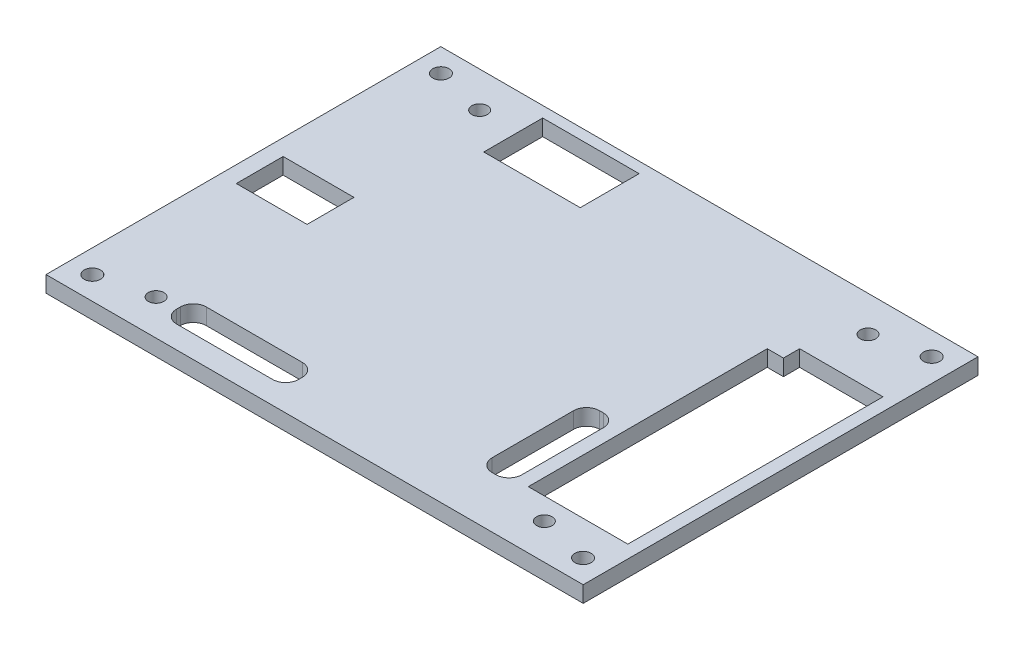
ISO-10303-21;
HEADER;
FILE_DESCRIPTION(('STEP AP214'),'2;1');
FILE_NAME('part.step','',(''),(''),'','','');
FILE_SCHEMA(('AUTOMOTIVE_DESIGN { 1 0 10303 214 1 1 1 1 }'));
ENDSEC;
DATA;
#1=APPLICATION_CONTEXT('core data for automotive mechanical design processes');
#2=APPLICATION_PROTOCOL_DEFINITION('international standard','automotive_design',2000,#1);
#3=PRODUCT_CONTEXT('',#1,'mechanical');
#4=PRODUCT('Part','Part','',(#3));
#5=PRODUCT_RELATED_PRODUCT_CATEGORY('part','',(#4));
#6=PRODUCT_DEFINITION_FORMATION('','',#4);
#7=PRODUCT_DEFINITION_CONTEXT('part definition',#1,'design');
#8=PRODUCT_DEFINITION('design','',#6,#7);
#9=PRODUCT_DEFINITION_SHAPE('','',#8);
#10=(LENGTH_UNIT() NAMED_UNIT(*) SI_UNIT(.MILLI.,.METRE.));
#11=(NAMED_UNIT(*) PLANE_ANGLE_UNIT() SI_UNIT($,.RADIAN.));
#12=(NAMED_UNIT(*) SI_UNIT($,.STERADIAN.) SOLID_ANGLE_UNIT());
#13=UNCERTAINTY_MEASURE_WITH_UNIT(LENGTH_MEASURE(1.E-05),#10,'distance_accuracy_value','');
#14=(GEOMETRIC_REPRESENTATION_CONTEXT(3) GLOBAL_UNCERTAINTY_ASSIGNED_CONTEXT((#13)) GLOBAL_UNIT_ASSIGNED_CONTEXT((#10,
#11,#12)) REPRESENTATION_CONTEXT('',''));
#15=CARTESIAN_POINT('',(0.,0.,0.));
#16=DIRECTION('',(0.,0.,1.));
#17=DIRECTION('',(1.,0.,0.));
#18=AXIS2_PLACEMENT_3D('',#15,#16,#17);
#19=CARTESIAN_POINT('',(0.,3.175,0.));
#20=DIRECTION('',(1.,0.,0.));
#21=DIRECTION('',(0.,0.,-1.));
#22=AXIS2_PLACEMENT_3D('',#19,#20,#21);
#23=PLANE('',#22);
#24=DIRECTION('',(0.,0.,1.));
#25=VECTOR('',#24,1.);
#26=CARTESIAN_POINT('',(0.,0.,0.));
#27=LINE('',#26,#25);
#28=CARTESIAN_POINT('',(0.,0.,-77.47));
#29=VERTEX_POINT('',#28);
#30=CARTESIAN_POINT('',(0.,0.,0.));
#31=VERTEX_POINT('',#30);
#32=EDGE_CURVE('E392',#29,#31,#27,.T.);
#33=ORIENTED_EDGE('',*,*,#32,.T.);
#34=DIRECTION('',(0.,-1.,0.));
#35=VECTOR('',#34,1.);
#36=CARTESIAN_POINT('',(0.,3.175,0.));
#37=LINE('',#36,#35);
#38=CARTESIAN_POINT('',(0.,3.175,0.));
#39=VERTEX_POINT('',#38);
#40=EDGE_CURVE('E421',#39,#31,#37,.T.);
#41=ORIENTED_EDGE('',*,*,#40,.F.);
#42=DIRECTION('',(0.,0.,1.));
#43=VECTOR('',#42,1.);
#44=CARTESIAN_POINT('',(0.,3.175,0.));
#45=LINE('',#44,#43);
#46=CARTESIAN_POINT('',(0.,3.175,-77.47));
#47=VERTEX_POINT('',#46);
#48=EDGE_CURVE('E395',#47,#39,#45,.T.);
#49=ORIENTED_EDGE('',*,*,#48,.F.);
#50=DIRECTION('',(0.,-1.,0.));
#51=VECTOR('',#50,1.);
#52=CARTESIAN_POINT('',(0.,3.175,-77.47));
#53=LINE('',#52,#51);
#54=EDGE_CURVE('E405',#47,#29,#53,.T.);
#55=ORIENTED_EDGE('',*,*,#54,.T.);
#56=EDGE_LOOP('',(#33,#41,#49,#55));
#57=FACE_BOUND('',#56,.T.);
#58=ADVANCED_FACE('F31',(#57),#23,.F.);
#59=CARTESIAN_POINT('',(0.,3.175,0.));
#60=DIRECTION('',(0.,0.,-1.));
#61=DIRECTION('',(-1.,0.,0.));
#62=AXIS2_PLACEMENT_3D('',#59,#60,#61);
#63=PLANE('',#62);
#64=DIRECTION('',(1.,0.,0.));
#65=VECTOR('',#64,1.);
#66=CARTESIAN_POINT('',(0.,0.,0.));
#67=LINE('',#66,#65);
#68=CARTESIAN_POINT('',(105.41,0.,0.));
#69=VERTEX_POINT('',#68);
#70=EDGE_CURVE('E408',#31,#69,#67,.T.);
#71=ORIENTED_EDGE('',*,*,#70,.T.);
#72=DIRECTION('',(0.,-1.,0.));
#73=VECTOR('',#72,1.);
#74=CARTESIAN_POINT('',(105.41,3.175,0.));
#75=LINE('',#74,#73);
#76=CARTESIAN_POINT('',(105.41,3.175,0.));
#77=VERTEX_POINT('',#76);
#78=EDGE_CURVE('E418',#77,#69,#75,.T.);
#79=ORIENTED_EDGE('',*,*,#78,.F.);
#80=DIRECTION('',(1.,0.,0.));
#81=VECTOR('',#80,1.);
#82=CARTESIAN_POINT('',(0.,3.175,0.));
#83=LINE('',#82,#81);
#84=EDGE_CURVE('E398',#39,#77,#83,.T.);
#85=ORIENTED_EDGE('',*,*,#84,.F.);
#86=ORIENTED_EDGE('',*,*,#40,.T.);
#87=EDGE_LOOP('',(#71,#79,#85,#86));
#88=FACE_BOUND('',#87,.T.);
#89=ADVANCED_FACE('F582',(#88),#63,.F.);
#90=CARTESIAN_POINT('',(105.41,3.175,0.));
#91=DIRECTION('',(-1.,0.,0.));
#92=DIRECTION('',(0.,0.,1.));
#93=AXIS2_PLACEMENT_3D('',#90,#91,#92);
#94=PLANE('',#93);
#95=DIRECTION('',(0.,0.,-1.));
#96=VECTOR('',#95,1.);
#97=CARTESIAN_POINT('',(105.41,0.,0.));
#98=LINE('',#97,#96);
#99=CARTESIAN_POINT('',(105.41,0.,-77.47));
#100=VERTEX_POINT('',#99);
#101=EDGE_CURVE('E410',#69,#100,#98,.T.);
#102=ORIENTED_EDGE('',*,*,#101,.T.);
#103=DIRECTION('',(0.,-1.,0.));
#104=VECTOR('',#103,1.);
#105=CARTESIAN_POINT('',(105.41,3.175,-77.47));
#106=LINE('',#105,#104);
#107=CARTESIAN_POINT('',(105.41,3.175,-77.47));
#108=VERTEX_POINT('',#107);
#109=EDGE_CURVE('E415',#108,#100,#106,.T.);
#110=ORIENTED_EDGE('',*,*,#109,.F.);
#111=DIRECTION('',(0.,0.,-1.));
#112=VECTOR('',#111,1.);
#113=CARTESIAN_POINT('',(105.41,3.175,0.));
#114=LINE('',#113,#112);
#115=EDGE_CURVE('E401',#77,#108,#114,.T.);
#116=ORIENTED_EDGE('',*,*,#115,.F.);
#117=ORIENTED_EDGE('',*,*,#78,.T.);
#118=EDGE_LOOP('',(#102,#110,#116,#117));
#119=FACE_BOUND('',#118,.T.);
#120=ADVANCED_FACE('F588',(#119),#94,.F.);
#121=CARTESIAN_POINT('',(0.,3.175,-77.47));
#122=DIRECTION('',(0.,0.,1.));
#123=DIRECTION('',(1.,0.,0.));
#124=AXIS2_PLACEMENT_3D('',#121,#122,#123);
#125=PLANE('',#124);
#126=DIRECTION('',(-1.,0.,0.));
#127=VECTOR('',#126,1.);
#128=CARTESIAN_POINT('',(0.,0.,-77.47));
#129=LINE('',#128,#127);
#130=EDGE_CURVE('E399',#100,#29,#129,.T.);
#131=ORIENTED_EDGE('',*,*,#130,.T.);
#132=ORIENTED_EDGE('',*,*,#54,.F.);
#133=DIRECTION('',(-1.,0.,0.));
#134=VECTOR('',#133,1.);
#135=CARTESIAN_POINT('',(0.,3.175,-77.47));
#136=LINE('',#135,#134);
#137=EDGE_CURVE('E403',#108,#47,#136,.T.);
#138=ORIENTED_EDGE('',*,*,#137,.F.);
#139=ORIENTED_EDGE('',*,*,#109,.T.);
#140=EDGE_LOOP('',(#131,#132,#138,#139));
#141=FACE_BOUND('',#140,.T.);
#142=ADVANCED_FACE('F664',(#141),#125,.F.);
#143=CARTESIAN_POINT('',(0.,3.175,-77.47));
#144=DIRECTION('',(0.,-1.,0.));
#145=DIRECTION('',(0.,0.,-1.));
#146=AXIS2_PLACEMENT_3D('',#143,#144,#145);
#147=PLANE('',#146);
#148=CARTESIAN_POINT('',(4.55930000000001,3.175,-4.53389999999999));
#149=DIRECTION('',(0.,1.,0.));
#150=DIRECTION('',(0.,0.,-1.));
#151=AXIS2_PLACEMENT_3D('',#148,#149,#150);
#152=CIRCLE('',#151,1.6);
#153=CARTESIAN_POINT('',(4.55930000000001,3.175,-6.13389999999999));
#154=VERTEX_POINT('',#153);
#155=EDGE_CURVE('E652',#154,#154,#152,.T.);
#156=ORIENTED_EDGE('',*,*,#155,.F.);
#157=EDGE_LOOP('',(#156));
#158=FACE_BOUND('',#157,.T.);
#159=CARTESIAN_POINT('',(100.8507,3.175,-4.53389999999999));
#160=DIRECTION('',(0.,1.,0.));
#161=DIRECTION('',(0.,0.,1.));
#162=AXIS2_PLACEMENT_3D('',#159,#160,#161);
#163=CIRCLE('',#162,1.60000000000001);
#164=CARTESIAN_POINT('',(100.8507,3.175,-2.93389999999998));
#165=VERTEX_POINT('',#164);
#166=EDGE_CURVE('E646',#165,#165,#163,.T.);
#167=ORIENTED_EDGE('',*,*,#166,.F.);
#168=EDGE_LOOP('',(#167));
#169=FACE_BOUND('',#168,.T.);
#170=CARTESIAN_POINT('',(100.8507,3.175,-72.9361));
#171=DIRECTION('',(0.,1.,0.));
#172=DIRECTION('',(0.,0.,-1.));
#173=AXIS2_PLACEMENT_3D('',#170,#171,#172);
#174=CIRCLE('',#173,1.60000000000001);
#175=CARTESIAN_POINT('',(100.8507,3.175,-74.5361));
#176=VERTEX_POINT('',#175);
#177=EDGE_CURVE('E641',#176,#176,#174,.T.);
#178=ORIENTED_EDGE('',*,*,#177,.F.);
#179=EDGE_LOOP('',(#178));
#180=FACE_BOUND('',#179,.T.);
#181=CARTESIAN_POINT('',(4.55930000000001,3.175,-72.9361));
#182=DIRECTION('',(0.,1.,0.));
#183=DIRECTION('',(0.,0.,1.));
#184=AXIS2_PLACEMENT_3D('',#181,#182,#183);
#185=CIRCLE('',#184,1.6);
#186=CARTESIAN_POINT('',(4.55930000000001,3.175,-71.3361));
#187=VERTEX_POINT('',#186);
#188=EDGE_CURVE('E635',#187,#187,#185,.T.);
#189=ORIENTED_EDGE('',*,*,#188,.F.);
#190=EDGE_LOOP('',(#189));
#191=FACE_BOUND('',#190,.T.);
#192=DIRECTION('',(1.,0.,0.));
#193=VECTOR('',#192,1.);
#194=CARTESIAN_POINT('',(74.8919,3.175,-10.1219));
#195=LINE('',#194,#193);
#196=CARTESIAN_POINT('',(77.4319,3.175,-10.1219));
#197=VERTEX_POINT('',#196);
#198=CARTESIAN_POINT('',(78.1685,3.175,-10.1219));
#199=VERTEX_POINT('',#198);
#200=EDGE_CURVE('E516',#197,#199,#195,.T.);
#201=ORIENTED_EDGE('',*,*,#200,.F.);
#202=CARTESIAN_POINT('',(77.4319,3.175,-12.6619));
#203=DIRECTION('',(0.,-1.,0.));
#204=DIRECTION('',(0.,0.,-1.));
#205=AXIS2_PLACEMENT_3D('',#202,#203,#204);
#206=CIRCLE('',#205,2.54);
#207=CARTESIAN_POINT('',(74.8919,3.175,-12.6619));
#208=VERTEX_POINT('',#207);
#209=EDGE_CURVE('E479',#197,#208,#206,.T.);
#210=ORIENTED_EDGE('',*,*,#209,.T.);
#211=DIRECTION('',(0.,0.,1.));
#212=VECTOR('',#211,1.);
#213=CARTESIAN_POINT('',(74.8919,3.175,-10.1219));
#214=LINE('',#213,#212);
#215=CARTESIAN_POINT('',(74.8919,3.175,-28.6385));
#216=VERTEX_POINT('',#215);
#217=EDGE_CURVE('E497',#216,#208,#214,.T.);
#218=ORIENTED_EDGE('',*,*,#217,.F.);
#219=CARTESIAN_POINT('',(77.4319,3.175,-28.6385));
#220=DIRECTION('',(0.,-1.,0.));
#221=DIRECTION('',(0.,0.,-1.));
#222=AXIS2_PLACEMENT_3D('',#219,#220,#221);
#223=CIRCLE('',#222,2.54);
#224=CARTESIAN_POINT('',(77.4319,3.175,-31.1785));
#225=VERTEX_POINT('',#224);
#226=EDGE_CURVE('E39',#216,#225,#223,.T.);
#227=ORIENTED_EDGE('',*,*,#226,.T.);
#228=DIRECTION('',(-1.,0.,0.));
#229=VECTOR('',#228,1.);
#230=CARTESIAN_POINT('',(74.8919,3.175,-31.1785));
#231=LINE('',#230,#229);
#232=CARTESIAN_POINT('',(78.1685,3.175,-31.1785));
#233=VERTEX_POINT('',#232);
#234=EDGE_CURVE('E495',#233,#225,#231,.T.);
#235=ORIENTED_EDGE('',*,*,#234,.F.);
#236=CARTESIAN_POINT('',(78.1685,3.175,-28.6385));
#237=DIRECTION('',(0.,-1.,0.));
#238=DIRECTION('',(0.,0.,-1.));
#239=AXIS2_PLACEMENT_3D('',#236,#237,#238);
#240=CIRCLE('',#239,2.54);
#241=CARTESIAN_POINT('',(80.7085,3.175,-28.6385));
#242=VERTEX_POINT('',#241);
#243=EDGE_CURVE('E487',#233,#242,#240,.T.);
#244=ORIENTED_EDGE('',*,*,#243,.T.);
#245=DIRECTION('',(0.,0.,-1.));
#246=VECTOR('',#245,1.);
#247=CARTESIAN_POINT('',(80.7085,3.175,-10.1219));
#248=LINE('',#247,#246);
#249=CARTESIAN_POINT('',(80.7085,3.175,-12.6619));
#250=VERTEX_POINT('',#249);
#251=EDGE_CURVE('E503',#250,#242,#248,.T.);
#252=ORIENTED_EDGE('',*,*,#251,.F.);
#253=CARTESIAN_POINT('',(78.1685,3.175,-12.6619));
#254=DIRECTION('',(0.,-1.,0.));
#255=DIRECTION('',(0.,0.,-1.));
#256=AXIS2_PLACEMENT_3D('',#253,#254,#255);
#257=CIRCLE('',#256,2.54);
#258=EDGE_CURVE('E483',#250,#199,#257,.T.);
#259=ORIENTED_EDGE('',*,*,#258,.T.);
#260=EDGE_LOOP('',(#201,#210,#218,#227,#235,#244,#252,#259));
#261=FACE_BOUND('',#260,.T.);
#262=DIRECTION('',(1.,0.,0.));
#263=VECTOR('',#262,1.);
#264=CARTESIAN_POINT('',(18.6817,3.175,-4.40689999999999));
#265=LINE('',#264,#263);
#266=CARTESIAN_POINT('',(21.2217,3.175,-4.40689999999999));
#267=VERTEX_POINT('',#266);
#268=CARTESIAN_POINT('',(40.0685,3.175,-4.40689999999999));
#269=VERTEX_POINT('',#268);
#270=EDGE_CURVE('E540',#267,#269,#265,.T.);
#271=ORIENTED_EDGE('',*,*,#270,.F.);
#272=CARTESIAN_POINT('',(21.2217,3.175,-6.94689999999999));
#273=DIRECTION('',(0.,-1.,0.));
#274=DIRECTION('',(0.,0.,-1.));
#275=AXIS2_PLACEMENT_3D('',#272,#273,#274);
#276=CIRCLE('',#275,2.54);
#277=CARTESIAN_POINT('',(18.6817,3.175,-6.94689999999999));
#278=VERTEX_POINT('',#277);
#279=EDGE_CURVE('E467',#267,#278,#276,.T.);
#280=ORIENTED_EDGE('',*,*,#279,.T.);
#281=DIRECTION('',(0.,0.,1.));
#282=VECTOR('',#281,1.);
#283=CARTESIAN_POINT('',(18.6817,3.175,-10.2235));
#284=LINE('',#283,#282);
#285=CARTESIAN_POINT('',(18.6817,3.175,-7.6835));
#286=VERTEX_POINT('',#285);
#287=EDGE_CURVE('E537',#286,#278,#284,.T.);
#288=ORIENTED_EDGE('',*,*,#287,.F.);
#289=CARTESIAN_POINT('',(21.2217,3.175,-7.6835));
#290=DIRECTION('',(0.,-1.,0.));
#291=DIRECTION('',(0.,0.,-1.));
#292=AXIS2_PLACEMENT_3D('',#289,#290,#291);
#293=CIRCLE('',#292,2.54);
#294=CARTESIAN_POINT('',(21.2217,3.175,-10.2235));
#295=VERTEX_POINT('',#294);
#296=EDGE_CURVE('E471',#286,#295,#293,.T.);
#297=ORIENTED_EDGE('',*,*,#296,.T.);
#298=DIRECTION('',(-1.,0.,0.));
#299=VECTOR('',#298,1.);
#300=CARTESIAN_POINT('',(18.6817,3.175,-10.2235));
#301=LINE('',#300,#299);
#302=CARTESIAN_POINT('',(40.0685,3.175,-10.2235));
#303=VERTEX_POINT('',#302);
#304=EDGE_CURVE('E546',#303,#295,#301,.T.);
#305=ORIENTED_EDGE('',*,*,#304,.F.);
#306=CARTESIAN_POINT('',(40.0685,3.175,-7.6835));
#307=DIRECTION('',(0.,-1.,0.));
#308=DIRECTION('',(0.,0.,-1.));
#309=AXIS2_PLACEMENT_3D('',#306,#307,#308);
#310=CIRCLE('',#309,2.54);
#311=CARTESIAN_POINT('',(42.6085,3.175,-7.6835));
#312=VERTEX_POINT('',#311);
#313=EDGE_CURVE('E475',#303,#312,#310,.T.);
#314=ORIENTED_EDGE('',*,*,#313,.T.);
#315=DIRECTION('',(0.,0.,-1.));
#316=VECTOR('',#315,1.);
#317=CARTESIAN_POINT('',(42.6085,3.175,-10.2235));
#318=LINE('',#317,#316);
#319=CARTESIAN_POINT('',(42.6085,3.175,-6.94689999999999));
#320=VERTEX_POINT('',#319);
#321=EDGE_CURVE('E543',#320,#312,#318,.T.);
#322=ORIENTED_EDGE('',*,*,#321,.F.);
#323=CARTESIAN_POINT('',(40.0685,3.175,-6.94689999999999));
#324=DIRECTION('',(0.,-1.,0.));
#325=DIRECTION('',(0.,0.,-1.));
#326=AXIS2_PLACEMENT_3D('',#323,#324,#325);
#327=CIRCLE('',#326,2.54);
#328=EDGE_CURVE('E463',#320,#269,#327,.T.);
#329=ORIENTED_EDGE('',*,*,#328,.T.);
#330=EDGE_LOOP('',(#271,#280,#288,#297,#305,#314,#322,#329));
#331=FACE_BOUND('',#330,.T.);
#332=DIRECTION('',(1.,0.,0.));
#333=VECTOR('',#332,1.);
#334=CARTESIAN_POINT('',(83.3628,3.175,-11.2776));
#335=LINE('',#334,#333);
#336=CARTESIAN_POINT('',(83.3628,3.175,-11.2776));
#337=VERTEX_POINT('',#336);
#338=CARTESIAN_POINT('',(102.8954,3.175,-11.2776));
#339=VERTEX_POINT('',#338);
#340=EDGE_CURVE('E281',#337,#339,#335,.T.);
#341=ORIENTED_EDGE('',*,*,#340,.F.);
#342=DIRECTION('',(0.,0.,1.));
#343=VECTOR('',#342,1.);
#344=CARTESIAN_POINT('',(83.3628,3.175,-11.2776));
#345=LINE('',#344,#343);
#346=CARTESIAN_POINT('',(83.3628,3.175,-58.166));
#347=VERTEX_POINT('',#346);
#348=EDGE_CURVE('E272',#347,#337,#345,.T.);
#349=ORIENTED_EDGE('',*,*,#348,.F.);
#350=DIRECTION('',(-1.,0.,0.));
#351=VECTOR('',#350,1.);
#352=CARTESIAN_POINT('',(83.3628,3.175,-58.166));
#353=LINE('',#352,#351);
#354=CARTESIAN_POINT('',(86.5378,3.175,-58.166));
#355=VERTEX_POINT('',#354);
#356=EDGE_CURVE('E273',#355,#347,#353,.T.);
#357=ORIENTED_EDGE('',*,*,#356,.F.);
#358=DIRECTION('',(0.,0.,1.));
#359=VECTOR('',#358,1.);
#360=CARTESIAN_POINT('',(86.5378,3.175,-61.341));
#361=LINE('',#360,#359);
#362=CARTESIAN_POINT('',(86.5378,3.175,-61.341));
#363=VERTEX_POINT('',#362);
#364=EDGE_CURVE('E294',#363,#355,#361,.T.);
#365=ORIENTED_EDGE('',*,*,#364,.F.);
#366=DIRECTION('',(-1.,0.,0.));
#367=VECTOR('',#366,1.);
#368=CARTESIAN_POINT('',(86.5378,3.175,-61.341));
#369=LINE('',#368,#367);
#370=CARTESIAN_POINT('',(102.8954,3.175,-61.341));
#371=VERTEX_POINT('',#370);
#372=EDGE_CURVE('E291',#371,#363,#369,.T.);
#373=ORIENTED_EDGE('',*,*,#372,.F.);
#374=DIRECTION('',(0.,0.,-1.));
#375=VECTOR('',#374,1.);
#376=CARTESIAN_POINT('',(102.8954,3.175,-11.2776));
#377=LINE('',#376,#375);
#378=EDGE_CURVE('E288',#339,#371,#377,.T.);
#379=ORIENTED_EDGE('',*,*,#378,.F.);
#380=EDGE_LOOP('',(#341,#349,#357,#365,#373,#379));
#381=FACE_BOUND('',#380,.T.);
#382=DIRECTION('',(1.,0.,0.));
#383=VECTOR('',#382,1.);
#384=CARTESIAN_POINT('',(3.2004,3.175,-34.1376));
#385=LINE('',#384,#383);
#386=CARTESIAN_POINT('',(3.2004,3.175,-34.1376));
#387=VERTEX_POINT('',#386);
#388=CARTESIAN_POINT('',(17.0942,3.175,-34.1376));
#389=VERTEX_POINT('',#388);
#390=EDGE_CURVE('E317',#387,#389,#385,.T.);
#391=ORIENTED_EDGE('',*,*,#390,.F.);
#392=DIRECTION('',(0.,0.,1.));
#393=VECTOR('',#392,1.);
#394=CARTESIAN_POINT('',(3.2004,3.175,-43.3324));
#395=LINE('',#394,#393);
#396=CARTESIAN_POINT('',(3.2004,3.175,-43.3324));
#397=VERTEX_POINT('',#396);
#398=EDGE_CURVE('E315',#397,#387,#395,.T.);
#399=ORIENTED_EDGE('',*,*,#398,.F.);
#400=DIRECTION('',(-1.,0.,0.));
#401=VECTOR('',#400,1.);
#402=CARTESIAN_POINT('',(3.2004,3.175,-43.3324));
#403=LINE('',#402,#401);
#404=CARTESIAN_POINT('',(17.0942,3.175,-43.3324));
#405=VERTEX_POINT('',#404);
#406=EDGE_CURVE('E323',#405,#397,#403,.T.);
#407=ORIENTED_EDGE('',*,*,#406,.F.);
#408=DIRECTION('',(0.,0.,-1.));
#409=VECTOR('',#408,1.);
#410=CARTESIAN_POINT('',(17.0942,3.175,-43.3324));
#411=LINE('',#410,#409);
#412=EDGE_CURVE('E320',#389,#405,#411,.T.);
#413=ORIENTED_EDGE('',*,*,#412,.F.);
#414=EDGE_LOOP('',(#391,#399,#407,#413));
#415=FACE_BOUND('',#414,.T.);
#416=DIRECTION('',(1.,0.,0.));
#417=VECTOR('',#416,1.);
#418=CARTESIAN_POINT('',(22.1234,3.175,-63.7794));
#419=LINE('',#418,#417);
#420=CARTESIAN_POINT('',(22.1234,3.175,-63.7794));
#421=VERTEX_POINT('',#420);
#422=CARTESIAN_POINT('',(41.0464,3.175,-63.7794));
#423=VERTEX_POINT('',#422);
#424=EDGE_CURVE('E349',#421,#423,#419,.T.);
#425=ORIENTED_EDGE('',*,*,#424,.F.);
#426=DIRECTION('',(0.,0.,1.));
#427=VECTOR('',#426,1.);
#428=CARTESIAN_POINT('',(22.1234,3.175,-75.3364));
#429=LINE('',#428,#427);
#430=CARTESIAN_POINT('',(22.1234,3.175,-75.3364));
#431=VERTEX_POINT('',#430);
#432=EDGE_CURVE('E347',#431,#421,#429,.T.);
#433=ORIENTED_EDGE('',*,*,#432,.F.);
#434=DIRECTION('',(-1.,0.,0.));
#435=VECTOR('',#434,1.);
#436=CARTESIAN_POINT('',(22.1234,3.175,-75.3364));
#437=LINE('',#436,#435);
#438=CARTESIAN_POINT('',(41.0464,3.175,-75.3364));
#439=VERTEX_POINT('',#438);
#440=EDGE_CURVE('E355',#439,#431,#437,.T.);
#441=ORIENTED_EDGE('',*,*,#440,.F.);
#442=DIRECTION('',(0.,0.,-1.));
#443=VECTOR('',#442,1.);
#444=CARTESIAN_POINT('',(41.0464,3.175,-75.3364));
#445=LINE('',#444,#443);
#446=EDGE_CURVE('E352',#423,#439,#445,.T.);
#447=ORIENTED_EDGE('',*,*,#446,.F.);
#448=EDGE_LOOP('',(#425,#433,#441,#447));
#449=FACE_BOUND('',#448,.T.);
#450=CARTESIAN_POINT('',(90.805,3.175,-6.98499999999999));
#451=DIRECTION('',(0.,1.,0.));
#452=DIRECTION('',(0.,0.,1.));
#453=AXIS2_PLACEMENT_3D('',#450,#451,#452);
#454=CIRCLE('',#453,1.52400000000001);
#455=CARTESIAN_POINT('',(90.805,3.175,-5.46099999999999));
#456=VERTEX_POINT('',#455);
#457=EDGE_CURVE('E371',#456,#456,#454,.T.);
#458=ORIENTED_EDGE('',*,*,#457,.F.);
#459=EDGE_LOOP('',(#458));
#460=FACE_BOUND('',#459,.T.);
#461=CARTESIAN_POINT('',(14.605,3.175,-6.98499999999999));
#462=DIRECTION('',(0.,1.,0.));
#463=DIRECTION('',(0.,0.,1.));
#464=AXIS2_PLACEMENT_3D('',#461,#462,#463);
#465=CIRCLE('',#464,1.52399999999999);
#466=CARTESIAN_POINT('',(14.605,3.175,-5.461));
#467=VERTEX_POINT('',#466);
#468=EDGE_CURVE('E377',#467,#467,#465,.T.);
#469=ORIENTED_EDGE('',*,*,#468,.F.);
#470=EDGE_LOOP('',(#469));
#471=FACE_BOUND('',#470,.T.);
#472=CARTESIAN_POINT('',(90.805,3.175,-70.485));
#473=DIRECTION('',(0.,1.,0.));
#474=DIRECTION('',(0.,0.,1.));
#475=AXIS2_PLACEMENT_3D('',#472,#473,#474);
#476=CIRCLE('',#475,1.52400000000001);
#477=CARTESIAN_POINT('',(90.805,3.175,-68.961));
#478=VERTEX_POINT('',#477);
#479=EDGE_CURVE('E383',#478,#478,#476,.T.);
#480=ORIENTED_EDGE('',*,*,#479,.F.);
#481=EDGE_LOOP('',(#480));
#482=FACE_BOUND('',#481,.T.);
#483=CARTESIAN_POINT('',(14.605,3.175,-70.485));
#484=DIRECTION('',(0.,1.,0.));
#485=DIRECTION('',(0.,0.,1.));
#486=AXIS2_PLACEMENT_3D('',#483,#484,#485);
#487=CIRCLE('',#486,1.52399999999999);
#488=CARTESIAN_POINT('',(14.605,3.175,-68.961));
#489=VERTEX_POINT('',#488);
#490=EDGE_CURVE('E389',#489,#489,#487,.T.);
#491=ORIENTED_EDGE('',*,*,#490,.F.);
#492=EDGE_LOOP('',(#491));
#493=FACE_BOUND('',#492,.T.);
#494=ORIENTED_EDGE('',*,*,#48,.T.);
#495=ORIENTED_EDGE('',*,*,#84,.T.);
#496=ORIENTED_EDGE('',*,*,#115,.T.);
#497=ORIENTED_EDGE('',*,*,#137,.T.);
#498=EDGE_LOOP('',(#494,#495,#496,#497));
#499=FACE_BOUND('',#498,.T.);
#500=ADVANCED_FACE('F493',(#158,#169,#180,#191,#261,#331,#381,#415,#449,#460,#471,#482,#493,
#499),#147,.F.);
#501=CARTESIAN_POINT('',(0.,0.,-77.47));
#502=DIRECTION('',(0.,-1.,0.));
#503=DIRECTION('',(0.,0.,-1.));
#504=AXIS2_PLACEMENT_3D('',#501,#502,#503);
#505=PLANE('',#504);
#506=CARTESIAN_POINT('',(4.55930000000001,0.,-4.53389999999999));
#507=DIRECTION('',(0.,-1.,0.));
#508=DIRECTION('',(0.,0.,-1.));
#509=AXIS2_PLACEMENT_3D('',#506,#507,#508);
#510=CIRCLE('',#509,1.6);
#511=CARTESIAN_POINT('',(4.55930000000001,0.,-6.13389999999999));
#512=VERTEX_POINT('',#511);
#513=EDGE_CURVE('E655',#512,#512,#510,.F.);
#514=ORIENTED_EDGE('',*,*,#513,.T.);
#515=EDGE_LOOP('',(#514));
#516=FACE_BOUND('',#515,.T.);
#517=CARTESIAN_POINT('',(100.8507,0.,-4.53389999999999));
#518=DIRECTION('',(0.,-1.,0.));
#519=DIRECTION('',(0.,0.,-1.));
#520=AXIS2_PLACEMENT_3D('',#517,#518,#519);
#521=CIRCLE('',#520,1.60000000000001);
#522=CARTESIAN_POINT('',(100.8507,0.,-6.13389999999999));
#523=VERTEX_POINT('',#522);
#524=EDGE_CURVE('E649',#523,#523,#521,.F.);
#525=ORIENTED_EDGE('',*,*,#524,.T.);
#526=EDGE_LOOP('',(#525));
#527=FACE_BOUND('',#526,.T.);
#528=CARTESIAN_POINT('',(100.8507,0.,-72.9361));
#529=DIRECTION('',(0.,-1.,0.));
#530=DIRECTION('',(0.,0.,-1.));
#531=AXIS2_PLACEMENT_3D('',#528,#529,#530);
#532=CIRCLE('',#531,1.60000000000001);
#533=CARTESIAN_POINT('',(100.8507,0.,-74.5361));
#534=VERTEX_POINT('',#533);
#535=EDGE_CURVE('E643',#534,#534,#532,.F.);
#536=ORIENTED_EDGE('',*,*,#535,.T.);
#537=EDGE_LOOP('',(#536));
#538=FACE_BOUND('',#537,.T.);
#539=CARTESIAN_POINT('',(4.55930000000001,0.,-72.9361));
#540=DIRECTION('',(0.,-1.,0.));
#541=DIRECTION('',(0.,0.,-1.));
#542=AXIS2_PLACEMENT_3D('',#539,#540,#541);
#543=CIRCLE('',#542,1.6);
#544=CARTESIAN_POINT('',(4.55930000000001,0.,-74.5361));
#545=VERTEX_POINT('',#544);
#546=EDGE_CURVE('E637',#545,#545,#543,.F.);
#547=ORIENTED_EDGE('',*,*,#546,.T.);
#548=EDGE_LOOP('',(#547));
#549=FACE_BOUND('',#548,.T.);
#550=DIRECTION('',(-1.,0.,0.));
#551=VECTOR('',#550,1.);
#552=CARTESIAN_POINT('',(74.8919,0.,-31.1785));
#553=LINE('',#552,#551);
#554=CARTESIAN_POINT('',(78.1685,0.,-31.1785));
#555=VERTEX_POINT('',#554);
#556=CARTESIAN_POINT('',(77.4319,0.,-31.1785));
#557=VERTEX_POINT('',#556);
#558=EDGE_CURVE('E511',#555,#557,#553,.T.);
#559=ORIENTED_EDGE('',*,*,#558,.T.);
#560=CARTESIAN_POINT('',(77.4319,0.,-28.6385));
#561=DIRECTION('',(0.,-1.,0.));
#562=DIRECTION('',(0.,0.,-1.));
#563=AXIS2_PLACEMENT_3D('',#560,#561,#562);
#564=CIRCLE('',#563,2.54);
#565=CARTESIAN_POINT('',(74.8919,0.,-28.6385));
#566=VERTEX_POINT('',#565);
#567=EDGE_CURVE('E11',#557,#566,#564,.F.);
#568=ORIENTED_EDGE('',*,*,#567,.T.);
#569=DIRECTION('',(0.,0.,1.));
#570=VECTOR('',#569,1.);
#571=CARTESIAN_POINT('',(74.8919,0.,-10.1219));
#572=LINE('',#571,#570);
#573=CARTESIAN_POINT('',(74.8919,0.,-12.6619));
#574=VERTEX_POINT('',#573);
#575=EDGE_CURVE('E509',#566,#574,#572,.T.);
#576=ORIENTED_EDGE('',*,*,#575,.T.);
#577=CARTESIAN_POINT('',(77.4319,0.,-12.6619));
#578=DIRECTION('',(0.,-1.,0.));
#579=DIRECTION('',(0.,0.,-1.));
#580=AXIS2_PLACEMENT_3D('',#577,#578,#579);
#581=CIRCLE('',#580,2.54);
#582=CARTESIAN_POINT('',(77.4319,0.,-10.1219));
#583=VERTEX_POINT('',#582);
#584=EDGE_CURVE('E481',#574,#583,#581,.F.);
#585=ORIENTED_EDGE('',*,*,#584,.T.);
#586=DIRECTION('',(1.,0.,0.));
#587=VECTOR('',#586,1.);
#588=CARTESIAN_POINT('',(74.8919,0.,-10.1219));
#589=LINE('',#588,#587);
#590=CARTESIAN_POINT('',(78.1685,0.,-10.1219));
#591=VERTEX_POINT('',#590);
#592=EDGE_CURVE('E502',#583,#591,#589,.T.);
#593=ORIENTED_EDGE('',*,*,#592,.T.);
#594=CARTESIAN_POINT('',(78.1685,0.,-12.6619));
#595=DIRECTION('',(0.,-1.,0.));
#596=DIRECTION('',(0.,0.,-1.));
#597=AXIS2_PLACEMENT_3D('',#594,#595,#596);
#598=CIRCLE('',#597,2.54);
#599=CARTESIAN_POINT('',(80.7085,0.,-12.6619));
#600=VERTEX_POINT('',#599);
#601=EDGE_CURVE('E485',#591,#600,#598,.F.);
#602=ORIENTED_EDGE('',*,*,#601,.T.);
#603=DIRECTION('',(0.,0.,-1.));
#604=VECTOR('',#603,1.);
#605=CARTESIAN_POINT('',(80.7085,0.,-10.1219));
#606=LINE('',#605,#604);
#607=CARTESIAN_POINT('',(80.7085,0.,-28.6385));
#608=VERTEX_POINT('',#607);
#609=EDGE_CURVE('E518',#600,#608,#606,.T.);
#610=ORIENTED_EDGE('',*,*,#609,.T.);
#611=CARTESIAN_POINT('',(78.1685,0.,-28.6385));
#612=DIRECTION('',(0.,-1.,0.));
#613=DIRECTION('',(0.,0.,-1.));
#614=AXIS2_PLACEMENT_3D('',#611,#612,#613);
#615=CIRCLE('',#614,2.54);
#616=EDGE_CURVE('E53',#608,#555,#615,.F.);
#617=ORIENTED_EDGE('',*,*,#616,.T.);
#618=EDGE_LOOP('',(#559,#568,#576,#585,#593,#602,#610,#617));
#619=FACE_BOUND('',#618,.T.);
#620=DIRECTION('',(-1.,0.,0.));
#621=VECTOR('',#620,1.);
#622=CARTESIAN_POINT('',(18.6817,0.,-10.2235));
#623=LINE('',#622,#621);
#624=CARTESIAN_POINT('',(40.0685,0.,-10.2235));
#625=VERTEX_POINT('',#624);
#626=CARTESIAN_POINT('',(21.2217,0.,-10.2235));
#627=VERTEX_POINT('',#626);
#628=EDGE_CURVE('E531',#625,#627,#623,.T.);
#629=ORIENTED_EDGE('',*,*,#628,.T.);
#630=CARTESIAN_POINT('',(21.2217,0.,-7.6835));
#631=DIRECTION('',(0.,-1.,0.));
#632=DIRECTION('',(0.,0.,-1.));
#633=AXIS2_PLACEMENT_3D('',#630,#631,#632);
#634=CIRCLE('',#633,2.54);
#635=CARTESIAN_POINT('',(18.6817,0.,-7.68349999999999));
#636=VERTEX_POINT('',#635);
#637=EDGE_CURVE('E473',#627,#636,#634,.F.);
#638=ORIENTED_EDGE('',*,*,#637,.T.);
#639=DIRECTION('',(0.,0.,1.));
#640=VECTOR('',#639,1.);
#641=CARTESIAN_POINT('',(18.6817,0.,-10.2235));
#642=LINE('',#641,#640);
#643=CARTESIAN_POINT('',(18.6817,0.,-6.94689999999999));
#644=VERTEX_POINT('',#643);
#645=EDGE_CURVE('E534',#636,#644,#642,.T.);
#646=ORIENTED_EDGE('',*,*,#645,.T.);
#647=CARTESIAN_POINT('',(21.2217,0.,-6.94689999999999));
#648=DIRECTION('',(0.,-1.,0.));
#649=DIRECTION('',(0.,0.,-1.));
#650=AXIS2_PLACEMENT_3D('',#647,#648,#649);
#651=CIRCLE('',#650,2.54);
#652=CARTESIAN_POINT('',(21.2217,0.,-4.40689999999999));
#653=VERTEX_POINT('',#652);
#654=EDGE_CURVE('E469',#644,#653,#651,.F.);
#655=ORIENTED_EDGE('',*,*,#654,.T.);
#656=DIRECTION('',(1.,0.,0.));
#657=VECTOR('',#656,1.);
#658=CARTESIAN_POINT('',(18.6817,0.,-4.40689999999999));
#659=LINE('',#658,#657);
#660=CARTESIAN_POINT('',(40.0685,0.,-4.40689999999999));
#661=VERTEX_POINT('',#660);
#662=EDGE_CURVE('E549',#653,#661,#659,.T.);
#663=ORIENTED_EDGE('',*,*,#662,.T.);
#664=CARTESIAN_POINT('',(40.0685,0.,-6.94689999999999));
#665=DIRECTION('',(0.,-1.,0.));
#666=DIRECTION('',(0.,0.,-1.));
#667=AXIS2_PLACEMENT_3D('',#664,#665,#666);
#668=CIRCLE('',#667,2.54);
#669=CARTESIAN_POINT('',(42.6085,0.,-6.94689999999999));
#670=VERTEX_POINT('',#669);
#671=EDGE_CURVE('E465',#661,#670,#668,.F.);
#672=ORIENTED_EDGE('',*,*,#671,.T.);
#673=DIRECTION('',(0.,0.,-1.));
#674=VECTOR('',#673,1.);
#675=CARTESIAN_POINT('',(42.6085,0.,-10.2235));
#676=LINE('',#675,#674);
#677=CARTESIAN_POINT('',(42.6085,0.,-7.6835));
#678=VERTEX_POINT('',#677);
#679=EDGE_CURVE('E528',#670,#678,#676,.T.);
#680=ORIENTED_EDGE('',*,*,#679,.T.);
#681=CARTESIAN_POINT('',(40.0685,0.,-7.6835));
#682=DIRECTION('',(0.,-1.,0.));
#683=DIRECTION('',(0.,0.,-1.));
#684=AXIS2_PLACEMENT_3D('',#681,#682,#683);
#685=CIRCLE('',#684,2.54);
#686=EDGE_CURVE('E477',#678,#625,#685,.F.);
#687=ORIENTED_EDGE('',*,*,#686,.T.);
#688=EDGE_LOOP('',(#629,#638,#646,#655,#663,#672,#680,#687));
#689=FACE_BOUND('',#688,.T.);
#690=DIRECTION('',(0.,0.,1.));
#691=VECTOR('',#690,1.);
#692=CARTESIAN_POINT('',(83.3628,0.,-11.2776));
#693=LINE('',#692,#691);
#694=CARTESIAN_POINT('',(83.3628,0.,-58.166));
#695=VERTEX_POINT('',#694);
#696=CARTESIAN_POINT('',(83.3628,0.,-11.2776));
#697=VERTEX_POINT('',#696);
#698=EDGE_CURVE('E269',#695,#697,#693,.T.);
#699=ORIENTED_EDGE('',*,*,#698,.T.);
#700=DIRECTION('',(1.,0.,0.));
#701=VECTOR('',#700,1.);
#702=CARTESIAN_POINT('',(83.3628,0.,-11.2776));
#703=LINE('',#702,#701);
#704=CARTESIAN_POINT('',(102.8954,0.,-11.2776));
#705=VERTEX_POINT('',#704);
#706=EDGE_CURVE('E253',#697,#705,#703,.T.);
#707=ORIENTED_EDGE('',*,*,#706,.T.);
#708=DIRECTION('',(0.,0.,-1.));
#709=VECTOR('',#708,1.);
#710=CARTESIAN_POINT('',(102.8954,0.,-11.2776));
#711=LINE('',#710,#709);
#712=CARTESIAN_POINT('',(102.8954,0.,-61.341));
#713=VERTEX_POINT('',#712);
#714=EDGE_CURVE('E552',#705,#713,#711,.T.);
#715=ORIENTED_EDGE('',*,*,#714,.T.);
#716=DIRECTION('',(-1.,0.,0.));
#717=VECTOR('',#716,1.);
#718=CARTESIAN_POINT('',(86.5378,0.,-61.341));
#719=LINE('',#718,#717);
#720=CARTESIAN_POINT('',(86.5378,0.,-61.341));
#721=VERTEX_POINT('',#720);
#722=EDGE_CURVE('E554',#713,#721,#719,.T.);
#723=ORIENTED_EDGE('',*,*,#722,.T.);
#724=DIRECTION('',(0.,0.,1.));
#725=VECTOR('',#724,1.);
#726=CARTESIAN_POINT('',(86.5378,0.,-61.341));
#727=LINE('',#726,#725);
#728=CARTESIAN_POINT('',(86.5378,0.,-58.166));
#729=VERTEX_POINT('',#728);
#730=EDGE_CURVE('E283',#721,#729,#727,.T.);
#731=ORIENTED_EDGE('',*,*,#730,.T.);
#732=DIRECTION('',(-1.,0.,0.));
#733=VECTOR('',#732,1.);
#734=CARTESIAN_POINT('',(83.3628,0.,-58.166));
#735=LINE('',#734,#733);
#736=EDGE_CURVE('E279',#729,#695,#735,.T.);
#737=ORIENTED_EDGE('',*,*,#736,.T.);
#738=EDGE_LOOP('',(#699,#707,#715,#723,#731,#737));
#739=FACE_BOUND('',#738,.T.);
#740=DIRECTION('',(0.,0.,1.));
#741=VECTOR('',#740,1.);
#742=CARTESIAN_POINT('',(3.2004,0.,-43.3324));
#743=LINE('',#742,#741);
#744=CARTESIAN_POINT('',(3.2004,0.,-43.3324));
#745=VERTEX_POINT('',#744);
#746=CARTESIAN_POINT('',(3.2004,0.,-34.1376));
#747=VERTEX_POINT('',#746);
#748=EDGE_CURVE('E312',#745,#747,#743,.T.);
#749=ORIENTED_EDGE('',*,*,#748,.T.);
#750=DIRECTION('',(1.,0.,0.));
#751=VECTOR('',#750,1.);
#752=CARTESIAN_POINT('',(3.2004,0.,-34.1376));
#753=LINE('',#752,#751);
#754=CARTESIAN_POINT('',(17.0942,0.,-34.1376));
#755=VERTEX_POINT('',#754);
#756=EDGE_CURVE('E329',#747,#755,#753,.T.);
#757=ORIENTED_EDGE('',*,*,#756,.T.);
#758=DIRECTION('',(0.,0.,-1.));
#759=VECTOR('',#758,1.);
#760=CARTESIAN_POINT('',(17.0942,0.,-43.3324));
#761=LINE('',#760,#759);
#762=CARTESIAN_POINT('',(17.0942,0.,-43.3324));
#763=VERTEX_POINT('',#762);
#764=EDGE_CURVE('E264',#755,#763,#761,.T.);
#765=ORIENTED_EDGE('',*,*,#764,.T.);
#766=DIRECTION('',(-1.,0.,0.));
#767=VECTOR('',#766,1.);
#768=CARTESIAN_POINT('',(3.2004,0.,-43.3324));
#769=LINE('',#768,#767);
#770=EDGE_CURVE('E309',#763,#745,#769,.T.);
#771=ORIENTED_EDGE('',*,*,#770,.T.);
#772=EDGE_LOOP('',(#749,#757,#765,#771));
#773=FACE_BOUND('',#772,.T.);
#774=DIRECTION('',(0.,0.,1.));
#775=VECTOR('',#774,1.);
#776=CARTESIAN_POINT('',(22.1234,0.,-75.3364));
#777=LINE('',#776,#775);
#778=CARTESIAN_POINT('',(22.1234,0.,-75.3364));
#779=VERTEX_POINT('',#778);
#780=CARTESIAN_POINT('',(22.1234,0.,-63.7794));
#781=VERTEX_POINT('',#780);
#782=EDGE_CURVE('E344',#779,#781,#777,.T.);
#783=ORIENTED_EDGE('',*,*,#782,.T.);
#784=DIRECTION('',(1.,0.,0.));
#785=VECTOR('',#784,1.);
#786=CARTESIAN_POINT('',(22.1234,0.,-63.7794));
#787=LINE('',#786,#785);
#788=CARTESIAN_POINT('',(41.0464,0.,-63.7794));
#789=VERTEX_POINT('',#788);
#790=EDGE_CURVE('E361',#781,#789,#787,.T.);
#791=ORIENTED_EDGE('',*,*,#790,.T.);
#792=DIRECTION('',(0.,0.,-1.));
#793=VECTOR('',#792,1.);
#794=CARTESIAN_POINT('',(41.0464,0.,-75.3364));
#795=LINE('',#794,#793);
#796=CARTESIAN_POINT('',(41.0464,0.,-75.3364));
#797=VERTEX_POINT('',#796);
#798=EDGE_CURVE('E338',#789,#797,#795,.T.);
#799=ORIENTED_EDGE('',*,*,#798,.T.);
#800=DIRECTION('',(-1.,0.,0.));
#801=VECTOR('',#800,1.);
#802=CARTESIAN_POINT('',(22.1234,0.,-75.3364));
#803=LINE('',#802,#801);
#804=EDGE_CURVE('E341',#797,#779,#803,.T.);
#805=ORIENTED_EDGE('',*,*,#804,.T.);
#806=EDGE_LOOP('',(#783,#791,#799,#805));
#807=FACE_BOUND('',#806,.T.);
#808=CARTESIAN_POINT('',(90.805,0.,-6.98499999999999));
#809=DIRECTION('',(0.,-1.,0.));
#810=DIRECTION('',(0.,0.,-1.));
#811=AXIS2_PLACEMENT_3D('',#808,#809,#810);
#812=CIRCLE('',#811,1.52400000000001);
#813=CARTESIAN_POINT('',(90.805,0.,-8.509));
#814=VERTEX_POINT('',#813);
#815=EDGE_CURVE('E370',#814,#814,#812,.F.);
#816=ORIENTED_EDGE('',*,*,#815,.T.);
#817=EDGE_LOOP('',(#816));
#818=FACE_BOUND('',#817,.T.);
#819=CARTESIAN_POINT('',(14.605,0.,-6.98499999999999));
#820=DIRECTION('',(0.,-1.,0.));
#821=DIRECTION('',(0.,0.,-1.));
#822=AXIS2_PLACEMENT_3D('',#819,#820,#821);
#823=CIRCLE('',#822,1.52399999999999);
#824=CARTESIAN_POINT('',(14.605,0.,-8.50899999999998));
#825=VERTEX_POINT('',#824);
#826=EDGE_CURVE('E374',#825,#825,#823,.F.);
#827=ORIENTED_EDGE('',*,*,#826,.T.);
#828=EDGE_LOOP('',(#827));
#829=FACE_BOUND('',#828,.T.);
#830=CARTESIAN_POINT('',(90.805,0.,-70.485));
#831=DIRECTION('',(0.,-1.,0.));
#832=DIRECTION('',(0.,0.,-1.));
#833=AXIS2_PLACEMENT_3D('',#830,#831,#832);
#834=CIRCLE('',#833,1.52400000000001);
#835=CARTESIAN_POINT('',(90.805,0.,-72.009));
#836=VERTEX_POINT('',#835);
#837=EDGE_CURVE('E380',#836,#836,#834,.F.);
#838=ORIENTED_EDGE('',*,*,#837,.T.);
#839=EDGE_LOOP('',(#838));
#840=FACE_BOUND('',#839,.T.);
#841=CARTESIAN_POINT('',(14.605,0.,-70.485));
#842=DIRECTION('',(0.,-1.,0.));
#843=DIRECTION('',(0.,0.,-1.));
#844=AXIS2_PLACEMENT_3D('',#841,#842,#843);
#845=CIRCLE('',#844,1.52399999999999);
#846=CARTESIAN_POINT('',(14.605,0.,-72.009));
#847=VERTEX_POINT('',#846);
#848=EDGE_CURVE('E386',#847,#847,#845,.F.);
#849=ORIENTED_EDGE('',*,*,#848,.T.);
#850=EDGE_LOOP('',(#849));
#851=FACE_BOUND('',#850,.T.);
#852=ORIENTED_EDGE('',*,*,#32,.F.);
#853=ORIENTED_EDGE('',*,*,#130,.F.);
#854=ORIENTED_EDGE('',*,*,#101,.F.);
#855=ORIENTED_EDGE('',*,*,#70,.F.);
#856=EDGE_LOOP('',(#852,#853,#854,#855));
#857=FACE_BOUND('',#856,.T.);
#858=ADVANCED_FACE('F276',(#516,#527,#538,#549,#619,#689,#739,#773,#807,#818,#829,#840,#851,
#857),#505,.T.);
#859=CARTESIAN_POINT('',(14.605,-0.00100000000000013,-70.485));
#860=DIRECTION('',(0.,1.,0.));
#861=DIRECTION('',(0.,0.,1.));
#862=AXIS2_PLACEMENT_3D('',#859,#860,#861);
#863=CYLINDRICAL_SURFACE('',#862,1.52399999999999);
#864=ORIENTED_EDGE('',*,*,#848,.F.);
#865=EDGE_LOOP('',(#864));
#866=FACE_BOUND('',#865,.T.);
#867=ORIENTED_EDGE('',*,*,#490,.T.);
#868=EDGE_LOOP('',(#867));
#869=FACE_BOUND('',#868,.T.);
#870=ADVANCED_FACE('F734',(#866,#869),#863,.F.);
#871=CARTESIAN_POINT('',(90.805,-0.00100000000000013,-70.485));
#872=DIRECTION('',(0.,1.,0.));
#873=DIRECTION('',(0.,0.,1.));
#874=AXIS2_PLACEMENT_3D('',#871,#872,#873);
#875=CYLINDRICAL_SURFACE('',#874,1.52400000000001);
#876=ORIENTED_EDGE('',*,*,#837,.F.);
#877=EDGE_LOOP('',(#876));
#878=FACE_BOUND('',#877,.T.);
#879=ORIENTED_EDGE('',*,*,#479,.T.);
#880=EDGE_LOOP('',(#879));
#881=FACE_BOUND('',#880,.T.);
#882=ADVANCED_FACE('F740',(#878,#881),#875,.F.);
#883=CARTESIAN_POINT('',(14.605,-0.00100000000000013,-6.98499999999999));
#884=DIRECTION('',(0.,1.,0.));
#885=DIRECTION('',(0.,0.,1.));
#886=AXIS2_PLACEMENT_3D('',#883,#884,#885);
#887=CYLINDRICAL_SURFACE('',#886,1.52399999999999);
#888=ORIENTED_EDGE('',*,*,#826,.F.);
#889=EDGE_LOOP('',(#888));
#890=FACE_BOUND('',#889,.T.);
#891=ORIENTED_EDGE('',*,*,#468,.T.);
#892=EDGE_LOOP('',(#891));
#893=FACE_BOUND('',#892,.T.);
#894=ADVANCED_FACE('F1024',(#890,#893),#887,.F.);
#895=CARTESIAN_POINT('',(90.805,-0.00100000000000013,-6.98499999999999));
#896=DIRECTION('',(0.,1.,0.));
#897=DIRECTION('',(0.,0.,1.));
#898=AXIS2_PLACEMENT_3D('',#895,#896,#897);
#899=CYLINDRICAL_SURFACE('',#898,1.52400000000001);
#900=ORIENTED_EDGE('',*,*,#815,.F.);
#901=EDGE_LOOP('',(#900));
#902=FACE_BOUND('',#901,.T.);
#903=ORIENTED_EDGE('',*,*,#457,.T.);
#904=EDGE_LOOP('',(#903));
#905=FACE_BOUND('',#904,.T.);
#906=ADVANCED_FACE('F1013',(#902,#905),#899,.F.);
#907=CARTESIAN_POINT('',(22.1234,-0.00100000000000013,-75.3364));
#908=DIRECTION('',(-1.,0.,0.));
#909=DIRECTION('',(0.,0.,1.));
#910=AXIS2_PLACEMENT_3D('',#907,#908,#909);
#911=PLANE('',#910);
#912=DIRECTION('',(0.,1.,0.));
#913=VECTOR('',#912,1.);
#914=CARTESIAN_POINT('',(22.1234,-0.00100000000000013,-75.3364));
#915=LINE('',#914,#913);
#916=EDGE_CURVE('E359',#779,#431,#915,.T.);
#917=ORIENTED_EDGE('',*,*,#916,.T.);
#918=ORIENTED_EDGE('',*,*,#432,.T.);
#919=DIRECTION('',(0.,1.,0.));
#920=VECTOR('',#919,1.);
#921=CARTESIAN_POINT('',(22.1234,-0.00100000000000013,-63.7794));
#922=LINE('',#921,#920);
#923=EDGE_CURVE('E358',#781,#421,#922,.T.);
#924=ORIENTED_EDGE('',*,*,#923,.F.);
#925=ORIENTED_EDGE('',*,*,#782,.F.);
#926=EDGE_LOOP('',(#917,#918,#924,#925));
#927=FACE_BOUND('',#926,.T.);
#928=ADVANCED_FACE('F1002',(#927),#911,.F.);
#929=CARTESIAN_POINT('',(22.1234,-0.00100000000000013,-75.3364));
#930=DIRECTION('',(0.,0.,-1.));
#931=DIRECTION('',(-1.,0.,0.));
#932=AXIS2_PLACEMENT_3D('',#929,#930,#931);
#933=PLANE('',#932);
#934=DIRECTION('',(0.,1.,0.));
#935=VECTOR('',#934,1.);
#936=CARTESIAN_POINT('',(41.0464,-0.00100000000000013,-75.3364));
#937=LINE('',#936,#935);
#938=EDGE_CURVE('E362',#797,#439,#937,.T.);
#939=ORIENTED_EDGE('',*,*,#938,.T.);
#940=ORIENTED_EDGE('',*,*,#440,.T.);
#941=ORIENTED_EDGE('',*,*,#916,.F.);
#942=ORIENTED_EDGE('',*,*,#804,.F.);
#943=EDGE_LOOP('',(#939,#940,#941,#942));
#944=FACE_BOUND('',#943,.T.);
#945=ADVANCED_FACE('F992',(#944),#933,.F.);
#946=CARTESIAN_POINT('',(41.0464,-0.00100000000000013,-75.3364));
#947=DIRECTION('',(1.,0.,0.));
#948=DIRECTION('',(0.,0.,-1.));
#949=AXIS2_PLACEMENT_3D('',#946,#947,#948);
#950=PLANE('',#949);
#951=DIRECTION('',(0.,1.,0.));
#952=VECTOR('',#951,1.);
#953=CARTESIAN_POINT('',(41.0464,-0.00100000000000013,-63.7794));
#954=LINE('',#953,#952);
#955=EDGE_CURVE('E364',#789,#423,#954,.T.);
#956=ORIENTED_EDGE('',*,*,#955,.T.);
#957=ORIENTED_EDGE('',*,*,#446,.T.);
#958=ORIENTED_EDGE('',*,*,#938,.F.);
#959=ORIENTED_EDGE('',*,*,#798,.F.);
#960=EDGE_LOOP('',(#956,#957,#958,#959));
#961=FACE_BOUND('',#960,.T.);
#962=ADVANCED_FACE('F982',(#961),#950,.F.);
#963=CARTESIAN_POINT('',(22.1234,-0.00100000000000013,-63.7794));
#964=DIRECTION('',(0.,0.,1.));
#965=DIRECTION('',(1.,0.,0.));
#966=AXIS2_PLACEMENT_3D('',#963,#964,#965);
#967=PLANE('',#966);
#968=ORIENTED_EDGE('',*,*,#923,.T.);
#969=ORIENTED_EDGE('',*,*,#424,.T.);
#970=ORIENTED_EDGE('',*,*,#955,.F.);
#971=ORIENTED_EDGE('',*,*,#790,.F.);
#972=EDGE_LOOP('',(#968,#969,#970,#971));
#973=FACE_BOUND('',#972,.T.);
#974=ADVANCED_FACE('F972',(#973),#967,.F.);
#975=CARTESIAN_POINT('',(3.2004,-0.00100000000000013,-43.3324));
#976=DIRECTION('',(-1.,0.,0.));
#977=DIRECTION('',(0.,0.,1.));
#978=AXIS2_PLACEMENT_3D('',#975,#976,#977);
#979=PLANE('',#978);
#980=DIRECTION('',(0.,1.,0.));
#981=VECTOR('',#980,1.);
#982=CARTESIAN_POINT('',(3.2004,-0.00100000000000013,-43.3324));
#983=LINE('',#982,#981);
#984=EDGE_CURVE('E327',#745,#397,#983,.T.);
#985=ORIENTED_EDGE('',*,*,#984,.T.);
#986=ORIENTED_EDGE('',*,*,#398,.T.);
#987=DIRECTION('',(0.,1.,0.));
#988=VECTOR('',#987,1.);
#989=CARTESIAN_POINT('',(3.2004,-0.00100000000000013,-34.1376));
#990=LINE('',#989,#988);
#991=EDGE_CURVE('E326',#747,#387,#990,.T.);
#992=ORIENTED_EDGE('',*,*,#991,.F.);
#993=ORIENTED_EDGE('',*,*,#748,.F.);
#994=EDGE_LOOP('',(#985,#986,#992,#993));
#995=FACE_BOUND('',#994,.T.);
#996=ADVANCED_FACE('F962',(#995),#979,.F.);
#997=CARTESIAN_POINT('',(3.2004,-0.00100000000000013,-43.3324));
#998=DIRECTION('',(0.,0.,-1.));
#999=DIRECTION('',(-1.,0.,0.));
#1000=AXIS2_PLACEMENT_3D('',#997,#998,#999);
#1001=PLANE('',#1000);
#1002=DIRECTION('',(0.,1.,0.));
#1003=VECTOR('',#1002,1.);
#1004=CARTESIAN_POINT('',(17.0942,-0.00100000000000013,-43.3324));
#1005=LINE('',#1004,#1003);
#1006=EDGE_CURVE('E330',#763,#405,#1005,.T.);
#1007=ORIENTED_EDGE('',*,*,#1006,.T.);
#1008=ORIENTED_EDGE('',*,*,#406,.T.);
#1009=ORIENTED_EDGE('',*,*,#984,.F.);
#1010=ORIENTED_EDGE('',*,*,#770,.F.);
#1011=EDGE_LOOP('',(#1007,#1008,#1009,#1010));
#1012=FACE_BOUND('',#1011,.T.);
#1013=ADVANCED_FACE('F952',(#1012),#1001,.F.);
#1014=CARTESIAN_POINT('',(17.0942,-0.00100000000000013,-43.3324));
#1015=DIRECTION('',(1.,0.,0.));
#1016=DIRECTION('',(0.,0.,-1.));
#1017=AXIS2_PLACEMENT_3D('',#1014,#1015,#1016);
#1018=PLANE('',#1017);
#1019=DIRECTION('',(0.,1.,0.));
#1020=VECTOR('',#1019,1.);
#1021=CARTESIAN_POINT('',(17.0942,-0.00100000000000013,-34.1376));
#1022=LINE('',#1021,#1020);
#1023=EDGE_CURVE('E332',#755,#389,#1022,.T.);
#1024=ORIENTED_EDGE('',*,*,#1023,.T.);
#1025=ORIENTED_EDGE('',*,*,#412,.T.);
#1026=ORIENTED_EDGE('',*,*,#1006,.F.);
#1027=ORIENTED_EDGE('',*,*,#764,.F.);
#1028=EDGE_LOOP('',(#1024,#1025,#1026,#1027));
#1029=FACE_BOUND('',#1028,.T.);
#1030=ADVANCED_FACE('F942',(#1029),#1018,.F.);
#1031=CARTESIAN_POINT('',(3.2004,-0.00100000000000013,-34.1376));
#1032=DIRECTION('',(0.,0.,1.));
#1033=DIRECTION('',(1.,0.,0.));
#1034=AXIS2_PLACEMENT_3D('',#1031,#1032,#1033);
#1035=PLANE('',#1034);
#1036=ORIENTED_EDGE('',*,*,#991,.T.);
#1037=ORIENTED_EDGE('',*,*,#390,.T.);
#1038=ORIENTED_EDGE('',*,*,#1023,.F.);
#1039=ORIENTED_EDGE('',*,*,#756,.F.);
#1040=EDGE_LOOP('',(#1036,#1037,#1038,#1039));
#1041=FACE_BOUND('',#1040,.T.);
#1042=ADVANCED_FACE('F578',(#1041),#1035,.F.);
#1043=CARTESIAN_POINT('',(83.3628,-0.00100000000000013,-11.2776));
#1044=DIRECTION('',(-1.,0.,0.));
#1045=DIRECTION('',(0.,0.,1.));
#1046=AXIS2_PLACEMENT_3D('',#1043,#1044,#1045);
#1047=PLANE('',#1046);
#1048=DIRECTION('',(0.,1.,0.));
#1049=VECTOR('',#1048,1.);
#1050=CARTESIAN_POINT('',(83.3628,-0.00100000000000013,-58.166));
#1051=LINE('',#1050,#1049);
#1052=EDGE_CURVE('E265',#695,#347,#1051,.T.);
#1053=ORIENTED_EDGE('',*,*,#1052,.T.);
#1054=ORIENTED_EDGE('',*,*,#348,.T.);
#1055=DIRECTION('',(0.,1.,0.));
#1056=VECTOR('',#1055,1.);
#1057=CARTESIAN_POINT('',(83.3628,-0.00100000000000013,-11.2776));
#1058=LINE('',#1057,#1056);
#1059=EDGE_CURVE('E257',#697,#337,#1058,.T.);
#1060=ORIENTED_EDGE('',*,*,#1059,.F.);
#1061=ORIENTED_EDGE('',*,*,#698,.F.);
#1062=EDGE_LOOP('',(#1053,#1054,#1060,#1061));
#1063=FACE_BOUND('',#1062,.T.);
#1064=ADVANCED_FACE('F268',(#1063),#1047,.F.);
#1065=CARTESIAN_POINT('',(83.3628,-0.00100000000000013,-58.166));
#1066=DIRECTION('',(0.,0.,-1.));
#1067=DIRECTION('',(-1.,0.,0.));
#1068=AXIS2_PLACEMENT_3D('',#1065,#1066,#1067);
#1069=PLANE('',#1068);
#1070=DIRECTION('',(0.,1.,0.));
#1071=VECTOR('',#1070,1.);
#1072=CARTESIAN_POINT('',(86.5378,-0.00100000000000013,-58.166));
#1073=LINE('',#1072,#1071);
#1074=EDGE_CURVE('E300',#729,#355,#1073,.T.);
#1075=ORIENTED_EDGE('',*,*,#1074,.T.);
#1076=ORIENTED_EDGE('',*,*,#356,.T.);
#1077=ORIENTED_EDGE('',*,*,#1052,.F.);
#1078=ORIENTED_EDGE('',*,*,#736,.F.);
#1079=EDGE_LOOP('',(#1075,#1076,#1077,#1078));
#1080=FACE_BOUND('',#1079,.T.);
#1081=ADVANCED_FACE('F570',(#1080),#1069,.F.);
#1082=CARTESIAN_POINT('',(86.5378,-0.00100000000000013,-61.341));
#1083=DIRECTION('',(-1.,0.,0.));
#1084=DIRECTION('',(0.,0.,1.));
#1085=AXIS2_PLACEMENT_3D('',#1082,#1083,#1084);
#1086=PLANE('',#1085);
#1087=DIRECTION('',(0.,1.,0.));
#1088=VECTOR('',#1087,1.);
#1089=CARTESIAN_POINT('',(86.5378,-0.00100000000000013,-61.341));
#1090=LINE('',#1089,#1088);
#1091=EDGE_CURVE('E302',#721,#363,#1090,.T.);
#1092=ORIENTED_EDGE('',*,*,#1091,.T.);
#1093=ORIENTED_EDGE('',*,*,#364,.T.);
#1094=ORIENTED_EDGE('',*,*,#1074,.F.);
#1095=ORIENTED_EDGE('',*,*,#730,.F.);
#1096=EDGE_LOOP('',(#1092,#1093,#1094,#1095));
#1097=FACE_BOUND('',#1096,.T.);
#1098=ADVANCED_FACE('F559',(#1097),#1086,.F.);
#1099=CARTESIAN_POINT('',(86.5378,-0.00100000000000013,-61.341));
#1100=DIRECTION('',(0.,0.,-1.));
#1101=DIRECTION('',(-1.,0.,0.));
#1102=AXIS2_PLACEMENT_3D('',#1099,#1100,#1101);
#1103=PLANE('',#1102);
#1104=DIRECTION('',(0.,1.,0.));
#1105=VECTOR('',#1104,1.);
#1106=CARTESIAN_POINT('',(102.8954,-0.00100000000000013,-61.341));
#1107=LINE('',#1106,#1105);
#1108=EDGE_CURVE('E304',#713,#371,#1107,.T.);
#1109=ORIENTED_EDGE('',*,*,#1108,.T.);
#1110=ORIENTED_EDGE('',*,*,#372,.T.);
#1111=ORIENTED_EDGE('',*,*,#1091,.F.);
#1112=ORIENTED_EDGE('',*,*,#722,.F.);
#1113=EDGE_LOOP('',(#1109,#1110,#1111,#1112));
#1114=FACE_BOUND('',#1113,.T.);
#1115=ADVANCED_FACE('F561',(#1114),#1103,.F.);
#1116=CARTESIAN_POINT('',(102.8954,-0.00100000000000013,-11.2776));
#1117=DIRECTION('',(1.,0.,0.));
#1118=DIRECTION('',(0.,0.,-1.));
#1119=AXIS2_PLACEMENT_3D('',#1116,#1117,#1118);
#1120=PLANE('',#1119);
#1121=DIRECTION('',(0.,1.,0.));
#1122=VECTOR('',#1121,1.);
#1123=CARTESIAN_POINT('',(102.8954,-0.00100000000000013,-11.2776));
#1124=LINE('',#1123,#1122);
#1125=EDGE_CURVE('E259',#705,#339,#1124,.T.);
#1126=ORIENTED_EDGE('',*,*,#1125,.T.);
#1127=ORIENTED_EDGE('',*,*,#378,.T.);
#1128=ORIENTED_EDGE('',*,*,#1108,.F.);
#1129=ORIENTED_EDGE('',*,*,#714,.F.);
#1130=EDGE_LOOP('',(#1126,#1127,#1128,#1129));
#1131=FACE_BOUND('',#1130,.T.);
#1132=ADVANCED_FACE('F711',(#1131),#1120,.F.);
#1133=CARTESIAN_POINT('',(83.3628,-0.00100000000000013,-11.2776));
#1134=DIRECTION('',(0.,0.,1.));
#1135=DIRECTION('',(1.,0.,0.));
#1136=AXIS2_PLACEMENT_3D('',#1133,#1134,#1135);
#1137=PLANE('',#1136);
#1138=ORIENTED_EDGE('',*,*,#1059,.T.);
#1139=ORIENTED_EDGE('',*,*,#340,.T.);
#1140=ORIENTED_EDGE('',*,*,#1125,.F.);
#1141=ORIENTED_EDGE('',*,*,#706,.F.);
#1142=EDGE_LOOP('',(#1138,#1139,#1140,#1141));
#1143=FACE_BOUND('',#1142,.T.);
#1144=ADVANCED_FACE('F255',(#1143),#1137,.F.);
#1145=CARTESIAN_POINT('',(18.6817,-0.00100000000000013,-10.2235));
#1146=DIRECTION('',(-1.,0.,0.));
#1147=DIRECTION('',(0.,0.,1.));
#1148=AXIS2_PLACEMENT_3D('',#1145,#1146,#1147);
#1149=PLANE('',#1148);
#1150=ORIENTED_EDGE('',*,*,#287,.T.);
#1151=DIRECTION('',(0.,1.,0.));
#1152=VECTOR('',#1151,1.);
#1153=CARTESIAN_POINT('',(18.6817,0.,-6.94689999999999));
#1154=LINE('',#1153,#1152);
#1155=EDGE_CURVE('E437',#278,#644,#1154,.F.);
#1156=ORIENTED_EDGE('',*,*,#1155,.T.);
#1157=ORIENTED_EDGE('',*,*,#645,.F.);
#1158=DIRECTION('',(0.,1.,0.));
#1159=VECTOR('',#1158,1.);
#1160=CARTESIAN_POINT('',(18.6817,3.175,-7.68349999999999));
#1161=LINE('',#1160,#1159);
#1162=EDGE_CURVE('E434',#636,#286,#1161,.T.);
#1163=ORIENTED_EDGE('',*,*,#1162,.T.);
#1164=EDGE_LOOP('',(#1150,#1156,#1157,#1163));
#1165=FACE_BOUND('',#1164,.T.);
#1166=ADVANCED_FACE('F699',(#1165),#1149,.F.);
#1167=CARTESIAN_POINT('',(18.6817,-0.00100000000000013,-10.2235));
#1168=DIRECTION('',(0.,0.,-1.));
#1169=DIRECTION('',(-1.,0.,0.));
#1170=AXIS2_PLACEMENT_3D('',#1167,#1168,#1169);
#1171=PLANE('',#1170);
#1172=ORIENTED_EDGE('',*,*,#304,.T.);
#1173=DIRECTION('',(0.,1.,0.));
#1174=VECTOR('',#1173,1.);
#1175=CARTESIAN_POINT('',(21.2217,0.,-10.2235));
#1176=LINE('',#1175,#1174);
#1177=EDGE_CURVE('E442',#295,#627,#1176,.F.);
#1178=ORIENTED_EDGE('',*,*,#1177,.T.);
#1179=ORIENTED_EDGE('',*,*,#628,.F.);
#1180=DIRECTION('',(0.,1.,0.));
#1181=VECTOR('',#1180,1.);
#1182=CARTESIAN_POINT('',(40.0685,3.175,-10.2235));
#1183=LINE('',#1182,#1181);
#1184=EDGE_CURVE('E439',#625,#303,#1183,.T.);
#1185=ORIENTED_EDGE('',*,*,#1184,.T.);
#1186=EDGE_LOOP('',(#1172,#1178,#1179,#1185));
#1187=FACE_BOUND('',#1186,.T.);
#1188=ADVANCED_FACE('F695',(#1187),#1171,.F.);
#1189=CARTESIAN_POINT('',(42.6085,-0.00100000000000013,-10.2235));
#1190=DIRECTION('',(1.,0.,0.));
#1191=DIRECTION('',(0.,0.,-1.));
#1192=AXIS2_PLACEMENT_3D('',#1189,#1190,#1191);
#1193=PLANE('',#1192);
#1194=ORIENTED_EDGE('',*,*,#679,.F.);
#1195=DIRECTION('',(0.,1.,0.));
#1196=VECTOR('',#1195,1.);
#1197=CARTESIAN_POINT('',(42.6085,3.175,-6.94689999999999));
#1198=LINE('',#1197,#1196);
#1199=EDGE_CURVE('E426',#670,#320,#1198,.T.);
#1200=ORIENTED_EDGE('',*,*,#1199,.T.);
#1201=ORIENTED_EDGE('',*,*,#321,.T.);
#1202=DIRECTION('',(0.,1.,0.));
#1203=VECTOR('',#1202,1.);
#1204=CARTESIAN_POINT('',(42.6085,0.,-7.6835));
#1205=LINE('',#1204,#1203);
#1206=EDGE_CURVE('E424',#312,#678,#1205,.F.);
#1207=ORIENTED_EDGE('',*,*,#1206,.T.);
#1208=EDGE_LOOP('',(#1194,#1200,#1201,#1207));
#1209=FACE_BOUND('',#1208,.T.);
#1210=ADVANCED_FACE('F698',(#1209),#1193,.F.);
#1211=CARTESIAN_POINT('',(18.6817,-0.00100000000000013,-4.40689999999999));
#1212=DIRECTION('',(0.,0.,1.));
#1213=DIRECTION('',(1.,0.,0.));
#1214=AXIS2_PLACEMENT_3D('',#1211,#1212,#1213);
#1215=PLANE('',#1214);
#1216=ORIENTED_EDGE('',*,*,#270,.T.);
#1217=DIRECTION('',(0.,1.,0.));
#1218=VECTOR('',#1217,1.);
#1219=CARTESIAN_POINT('',(40.0685,0.,-4.40689999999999));
#1220=LINE('',#1219,#1218);
#1221=EDGE_CURVE('E432',#269,#661,#1220,.F.);
#1222=ORIENTED_EDGE('',*,*,#1221,.T.);
#1223=ORIENTED_EDGE('',*,*,#662,.F.);
#1224=DIRECTION('',(0.,1.,0.));
#1225=VECTOR('',#1224,1.);
#1226=CARTESIAN_POINT('',(21.2217,3.175,-4.40689999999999));
#1227=LINE('',#1226,#1225);
#1228=EDGE_CURVE('E429',#653,#267,#1227,.T.);
#1229=ORIENTED_EDGE('',*,*,#1228,.T.);
#1230=EDGE_LOOP('',(#1216,#1222,#1223,#1229));
#1231=FACE_BOUND('',#1230,.T.);
#1232=ADVANCED_FACE('F694',(#1231),#1215,.F.);
#1233=CARTESIAN_POINT('',(74.8919,-0.00100000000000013,-10.1219));
#1234=DIRECTION('',(-1.,0.,0.));
#1235=DIRECTION('',(0.,0.,1.));
#1236=AXIS2_PLACEMENT_3D('',#1233,#1234,#1235);
#1237=PLANE('',#1236);
#1238=ORIENTED_EDGE('',*,*,#217,.T.);
#1239=DIRECTION('',(0.,1.,0.));
#1240=VECTOR('',#1239,1.);
#1241=CARTESIAN_POINT('',(74.8919,0.,-12.6619));
#1242=LINE('',#1241,#1240);
#1243=EDGE_CURVE('E452',#208,#574,#1242,.F.);
#1244=ORIENTED_EDGE('',*,*,#1243,.T.);
#1245=ORIENTED_EDGE('',*,*,#575,.F.);
#1246=DIRECTION('',(0.,1.,0.));
#1247=VECTOR('',#1246,1.);
#1248=CARTESIAN_POINT('',(74.8919,3.175,-28.6385));
#1249=LINE('',#1248,#1247);
#1250=EDGE_CURVE('E449',#566,#216,#1249,.T.);
#1251=ORIENTED_EDGE('',*,*,#1250,.T.);
#1252=EDGE_LOOP('',(#1238,#1244,#1245,#1251));
#1253=FACE_BOUND('',#1252,.T.);
#1254=ADVANCED_FACE('F513',(#1253),#1237,.F.);
#1255=CARTESIAN_POINT('',(74.8919,-0.00100000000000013,-31.1785));
#1256=DIRECTION('',(0.,0.,-1.));
#1257=DIRECTION('',(-1.,0.,0.));
#1258=AXIS2_PLACEMENT_3D('',#1255,#1256,#1257);
#1259=PLANE('',#1258);
#1260=ORIENTED_EDGE('',*,*,#558,.F.);
#1261=DIRECTION('',(0.,1.,0.));
#1262=VECTOR('',#1261,1.);
#1263=CARTESIAN_POINT('',(78.1685,3.175,-31.1785));
#1264=LINE('',#1263,#1262);
#1265=EDGE_CURVE('E460',#555,#233,#1264,.T.);
#1266=ORIENTED_EDGE('',*,*,#1265,.T.);
#1267=ORIENTED_EDGE('',*,*,#234,.T.);
#1268=DIRECTION('',(0.,1.,0.));
#1269=VECTOR('',#1268,1.);
#1270=CARTESIAN_POINT('',(77.4319,0.,-31.1785));
#1271=LINE('',#1270,#1269);
#1272=EDGE_CURVE('E46',#225,#557,#1271,.F.);
#1273=ORIENTED_EDGE('',*,*,#1272,.T.);
#1274=EDGE_LOOP('',(#1260,#1266,#1267,#1273));
#1275=FACE_BOUND('',#1274,.T.);
#1276=ADVANCED_FACE('F500',(#1275),#1259,.F.);
#1277=CARTESIAN_POINT('',(80.7085,-0.00100000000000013,-10.1219));
#1278=DIRECTION('',(1.,0.,0.));
#1279=DIRECTION('',(0.,0.,-1.));
#1280=AXIS2_PLACEMENT_3D('',#1277,#1278,#1279);
#1281=PLANE('',#1280);
#1282=ORIENTED_EDGE('',*,*,#609,.F.);
#1283=DIRECTION('',(0.,1.,0.));
#1284=VECTOR('',#1283,1.);
#1285=CARTESIAN_POINT('',(80.7085,3.175,-12.6619));
#1286=LINE('',#1285,#1284);
#1287=EDGE_CURVE('E456',#600,#250,#1286,.T.);
#1288=ORIENTED_EDGE('',*,*,#1287,.T.);
#1289=ORIENTED_EDGE('',*,*,#251,.T.);
#1290=DIRECTION('',(0.,1.,0.));
#1291=VECTOR('',#1290,1.);
#1292=CARTESIAN_POINT('',(80.7085,0.,-28.6385));
#1293=LINE('',#1292,#1291);
#1294=EDGE_CURVE('E454',#242,#608,#1293,.F.);
#1295=ORIENTED_EDGE('',*,*,#1294,.T.);
#1296=EDGE_LOOP('',(#1282,#1288,#1289,#1295));
#1297=FACE_BOUND('',#1296,.T.);
#1298=ADVANCED_FACE('F627',(#1297),#1281,.F.);
#1299=CARTESIAN_POINT('',(74.8919,-0.00100000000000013,-10.1219));
#1300=DIRECTION('',(0.,0.,1.));
#1301=DIRECTION('',(1.,0.,0.));
#1302=AXIS2_PLACEMENT_3D('',#1299,#1300,#1301);
#1303=PLANE('',#1302);
#1304=ORIENTED_EDGE('',*,*,#592,.F.);
#1305=DIRECTION('',(0.,1.,0.));
#1306=VECTOR('',#1305,1.);
#1307=CARTESIAN_POINT('',(77.4319,3.175,-10.1219));
#1308=LINE('',#1307,#1306);
#1309=EDGE_CURVE('E446',#583,#197,#1308,.T.);
#1310=ORIENTED_EDGE('',*,*,#1309,.T.);
#1311=ORIENTED_EDGE('',*,*,#200,.T.);
#1312=DIRECTION('',(0.,1.,0.));
#1313=VECTOR('',#1312,1.);
#1314=CARTESIAN_POINT('',(78.1685,0.,-10.1219));
#1315=LINE('',#1314,#1313);
#1316=EDGE_CURVE('E444',#199,#591,#1315,.F.);
#1317=ORIENTED_EDGE('',*,*,#1316,.T.);
#1318=EDGE_LOOP('',(#1304,#1310,#1311,#1317));
#1319=FACE_BOUND('',#1318,.T.);
#1320=ADVANCED_FACE('F633',(#1319),#1303,.F.);
#1321=CARTESIAN_POINT('',(4.55930000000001,-0.00100000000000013,-72.9361));
#1322=DIRECTION('',(0.,1.,0.));
#1323=DIRECTION('',(0.,0.,1.));
#1324=AXIS2_PLACEMENT_3D('',#1321,#1322,#1323);
#1325=CYLINDRICAL_SURFACE('',#1324,1.6);
#1326=ORIENTED_EDGE('',*,*,#546,.F.);
#1327=EDGE_LOOP('',(#1326));
#1328=FACE_BOUND('',#1327,.T.);
#1329=ORIENTED_EDGE('',*,*,#188,.T.);
#1330=EDGE_LOOP('',(#1329));
#1331=FACE_BOUND('',#1330,.T.);
#1332=ADVANCED_FACE('F672',(#1328,#1331),#1325,.F.);
#1333=CARTESIAN_POINT('',(100.8507,-0.00100000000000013,-72.9361));
#1334=DIRECTION('',(0.,1.,0.));
#1335=DIRECTION('',(0.,0.,1.));
#1336=AXIS2_PLACEMENT_3D('',#1333,#1334,#1335);
#1337=CYLINDRICAL_SURFACE('',#1336,1.60000000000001);
#1338=ORIENTED_EDGE('',*,*,#535,.F.);
#1339=EDGE_LOOP('',(#1338));
#1340=FACE_BOUND('',#1339,.T.);
#1341=ORIENTED_EDGE('',*,*,#177,.T.);
#1342=EDGE_LOOP('',(#1341));
#1343=FACE_BOUND('',#1342,.T.);
#1344=ADVANCED_FACE('F674',(#1340,#1343),#1337,.F.);
#1345=CARTESIAN_POINT('',(100.8507,-0.00100000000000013,-4.53389999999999));
#1346=DIRECTION('',(0.,1.,0.));
#1347=DIRECTION('',(0.,0.,1.));
#1348=AXIS2_PLACEMENT_3D('',#1345,#1346,#1347);
#1349=CYLINDRICAL_SURFACE('',#1348,1.60000000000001);
#1350=ORIENTED_EDGE('',*,*,#524,.F.);
#1351=EDGE_LOOP('',(#1350));
#1352=FACE_BOUND('',#1351,.T.);
#1353=ORIENTED_EDGE('',*,*,#166,.T.);
#1354=EDGE_LOOP('',(#1353));
#1355=FACE_BOUND('',#1354,.T.);
#1356=ADVANCED_FACE('F681',(#1352,#1355),#1349,.F.);
#1357=CARTESIAN_POINT('',(4.55930000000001,-0.00100000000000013,-4.53389999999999));
#1358=DIRECTION('',(0.,1.,0.));
#1359=DIRECTION('',(0.,0.,1.));
#1360=AXIS2_PLACEMENT_3D('',#1357,#1358,#1359);
#1361=CYLINDRICAL_SURFACE('',#1360,1.6);
#1362=ORIENTED_EDGE('',*,*,#513,.F.);
#1363=EDGE_LOOP('',(#1362));
#1364=FACE_BOUND('',#1363,.T.);
#1365=ORIENTED_EDGE('',*,*,#155,.T.);
#1366=EDGE_LOOP('',(#1365));
#1367=FACE_BOUND('',#1366,.T.);
#1368=ADVANCED_FACE('F597',(#1364,#1367),#1361,.F.);
#1369=CARTESIAN_POINT('',(40.0685,-0.00100000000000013,-6.94689999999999));
#1370=DIRECTION('',(0.,-1.,0.));
#1371=DIRECTION('',(0.,0.,-1.));
#1372=AXIS2_PLACEMENT_3D('',#1369,#1370,#1371);
#1373=CYLINDRICAL_SURFACE('',#1372,2.54);
#1374=ORIENTED_EDGE('',*,*,#671,.F.);
#1375=ORIENTED_EDGE('',*,*,#1221,.F.);
#1376=ORIENTED_EDGE('',*,*,#328,.F.);
#1377=ORIENTED_EDGE('',*,*,#1199,.F.);
#1378=EDGE_LOOP('',(#1374,#1375,#1376,#1377));
#1379=FACE_BOUND('',#1378,.T.);
#1380=ADVANCED_FACE('F593',(#1379),#1373,.F.);
#1381=CARTESIAN_POINT('',(21.2217,-0.00100000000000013,-6.94689999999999));
#1382=DIRECTION('',(0.,-1.,0.));
#1383=DIRECTION('',(0.,0.,-1.));
#1384=AXIS2_PLACEMENT_3D('',#1381,#1382,#1383);
#1385=CYLINDRICAL_SURFACE('',#1384,2.54);
#1386=ORIENTED_EDGE('',*,*,#654,.F.);
#1387=ORIENTED_EDGE('',*,*,#1155,.F.);
#1388=ORIENTED_EDGE('',*,*,#279,.F.);
#1389=ORIENTED_EDGE('',*,*,#1228,.F.);
#1390=EDGE_LOOP('',(#1386,#1387,#1388,#1389));
#1391=FACE_BOUND('',#1390,.T.);
#1392=ADVANCED_FACE('F596',(#1391),#1385,.F.);
#1393=CARTESIAN_POINT('',(21.2217,-0.00100000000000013,-7.6835));
#1394=DIRECTION('',(0.,-1.,0.));
#1395=DIRECTION('',(0.,0.,-1.));
#1396=AXIS2_PLACEMENT_3D('',#1393,#1394,#1395);
#1397=CYLINDRICAL_SURFACE('',#1396,2.54);
#1398=ORIENTED_EDGE('',*,*,#637,.F.);
#1399=ORIENTED_EDGE('',*,*,#1177,.F.);
#1400=ORIENTED_EDGE('',*,*,#296,.F.);
#1401=ORIENTED_EDGE('',*,*,#1162,.F.);
#1402=EDGE_LOOP('',(#1398,#1399,#1400,#1401));
#1403=FACE_BOUND('',#1402,.T.);
#1404=ADVANCED_FACE('F601',(#1403),#1397,.F.);
#1405=CARTESIAN_POINT('',(40.0685,-0.00100000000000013,-7.6835));
#1406=DIRECTION('',(0.,-1.,0.));
#1407=DIRECTION('',(0.,0.,-1.));
#1408=AXIS2_PLACEMENT_3D('',#1405,#1406,#1407);
#1409=CYLINDRICAL_SURFACE('',#1408,2.54);
#1410=ORIENTED_EDGE('',*,*,#686,.F.);
#1411=ORIENTED_EDGE('',*,*,#1206,.F.);
#1412=ORIENTED_EDGE('',*,*,#313,.F.);
#1413=ORIENTED_EDGE('',*,*,#1184,.F.);
#1414=EDGE_LOOP('',(#1410,#1411,#1412,#1413));
#1415=FACE_BOUND('',#1414,.T.);
#1416=ADVANCED_FACE('F605',(#1415),#1409,.F.);
#1417=CARTESIAN_POINT('',(77.4319,-0.00100000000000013,-12.6619));
#1418=DIRECTION('',(0.,-1.,0.));
#1419=DIRECTION('',(0.,0.,-1.));
#1420=AXIS2_PLACEMENT_3D('',#1417,#1418,#1419);
#1421=CYLINDRICAL_SURFACE('',#1420,2.54);
#1422=ORIENTED_EDGE('',*,*,#584,.F.);
#1423=ORIENTED_EDGE('',*,*,#1243,.F.);
#1424=ORIENTED_EDGE('',*,*,#209,.F.);
#1425=ORIENTED_EDGE('',*,*,#1309,.F.);
#1426=EDGE_LOOP('',(#1422,#1423,#1424,#1425));
#1427=FACE_BOUND('',#1426,.T.);
#1428=ADVANCED_FACE('F609',(#1427),#1421,.F.);
#1429=CARTESIAN_POINT('',(78.1685,-0.00100000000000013,-12.6619));
#1430=DIRECTION('',(0.,-1.,0.));
#1431=DIRECTION('',(0.,0.,-1.));
#1432=AXIS2_PLACEMENT_3D('',#1429,#1430,#1431);
#1433=CYLINDRICAL_SURFACE('',#1432,2.54);
#1434=ORIENTED_EDGE('',*,*,#601,.F.);
#1435=ORIENTED_EDGE('',*,*,#1316,.F.);
#1436=ORIENTED_EDGE('',*,*,#258,.F.);
#1437=ORIENTED_EDGE('',*,*,#1287,.F.);
#1438=EDGE_LOOP('',(#1434,#1435,#1436,#1437));
#1439=FACE_BOUND('',#1438,.T.);
#1440=ADVANCED_FACE('F613',(#1439),#1433,.F.);
#1441=CARTESIAN_POINT('',(78.1685,-0.00100000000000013,-28.6385));
#1442=DIRECTION('',(0.,-1.,0.));
#1443=DIRECTION('',(0.,0.,-1.));
#1444=AXIS2_PLACEMENT_3D('',#1441,#1442,#1443);
#1445=CYLINDRICAL_SURFACE('',#1444,2.54);
#1446=ORIENTED_EDGE('',*,*,#616,.F.);
#1447=ORIENTED_EDGE('',*,*,#1294,.F.);
#1448=ORIENTED_EDGE('',*,*,#243,.F.);
#1449=ORIENTED_EDGE('',*,*,#1265,.F.);
#1450=EDGE_LOOP('',(#1446,#1447,#1448,#1449));
#1451=FACE_BOUND('',#1450,.T.);
#1452=ADVANCED_FACE('F616',(#1451),#1445,.F.);
#1453=CARTESIAN_POINT('',(77.4319,-0.00100000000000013,-28.6385));
#1454=DIRECTION('',(0.,-1.,0.));
#1455=DIRECTION('',(0.,0.,-1.));
#1456=AXIS2_PLACEMENT_3D('',#1453,#1454,#1455);
#1457=CYLINDRICAL_SURFACE('',#1456,2.54);
#1458=ORIENTED_EDGE('',*,*,#567,.F.);
#1459=ORIENTED_EDGE('',*,*,#1272,.F.);
#1460=ORIENTED_EDGE('',*,*,#226,.F.);
#1461=ORIENTED_EDGE('',*,*,#1250,.F.);
#1462=EDGE_LOOP('',(#1458,#1459,#1460,#1461));
#1463=FACE_BOUND('',#1462,.T.);
#1464=ADVANCED_FACE('F33',(#1463),#1457,.F.);
#1465=CLOSED_SHELL('',(#58,#89,#120,#142,#500,#858,#870,#882,#894,#906,#928,#945,#962,#974,#996,
#1013,#1030,#1042,#1064,#1081,#1098,#1115,#1132,#1144,#1166,#1188,#1210,#1232,#1254,#1276,#1298,
#1320,#1332,#1344,#1356,#1368,#1380,#1392,#1404,#1416,#1428,#1440,#1452,#1464));
#1466=MANIFOLD_SOLID_BREP('B2',#1465);
#1467=ADVANCED_BREP_SHAPE_REPRESENTATION('',(#18,#1466),#14);
#1468=SHAPE_DEFINITION_REPRESENTATION(#9,#1467);
ENDSEC;
END-ISO-10303-21;
